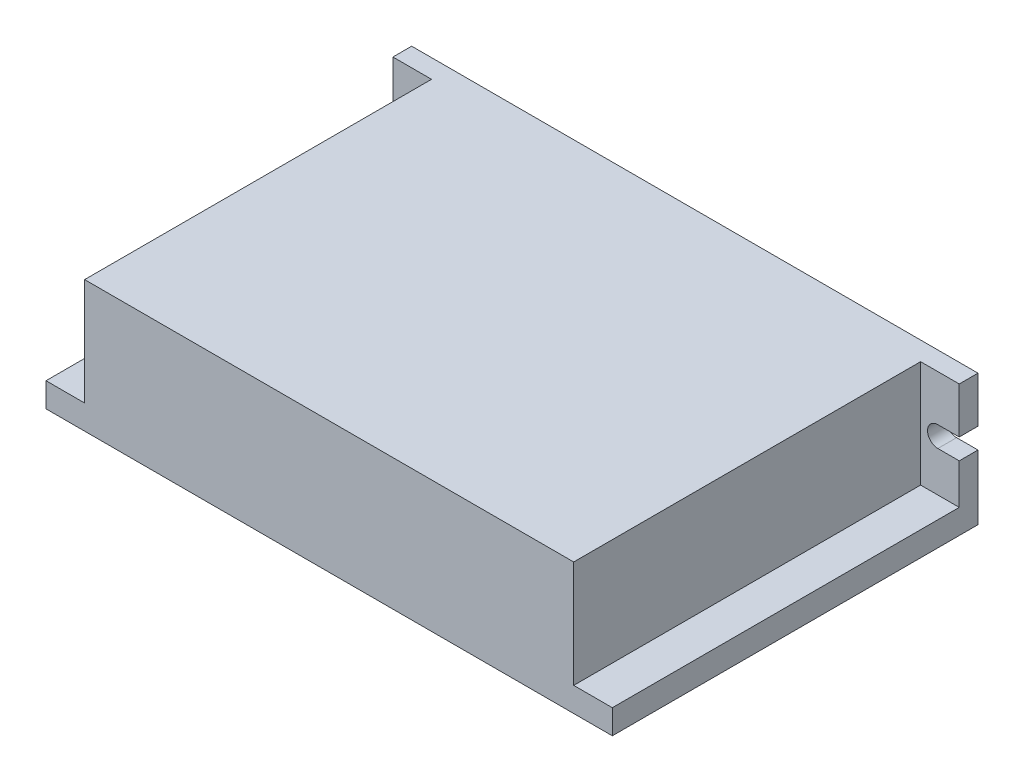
ISO-10303-21;
HEADER;
FILE_DESCRIPTION(('STEP AP214'),'2;1');
FILE_NAME('part.step','',(''),(''),'','','');
FILE_SCHEMA(('AUTOMOTIVE_DESIGN { 1 0 10303 214 1 1 1 1 }'));
ENDSEC;
DATA;
#1=APPLICATION_CONTEXT('core data for automotive mechanical design processes');
#2=APPLICATION_PROTOCOL_DEFINITION('international standard','automotive_design',2000,#1);
#3=PRODUCT_CONTEXT('',#1,'mechanical');
#4=PRODUCT('Part','Part','',(#3));
#5=PRODUCT_RELATED_PRODUCT_CATEGORY('part','',(#4));
#6=PRODUCT_DEFINITION_FORMATION('','',#4);
#7=PRODUCT_DEFINITION_CONTEXT('part definition',#1,'design');
#8=PRODUCT_DEFINITION('design','',#6,#7);
#9=PRODUCT_DEFINITION_SHAPE('','',#8);
#10=(LENGTH_UNIT() NAMED_UNIT(*) SI_UNIT(.MILLI.,.METRE.));
#11=(NAMED_UNIT(*) PLANE_ANGLE_UNIT() SI_UNIT($,.RADIAN.));
#12=(NAMED_UNIT(*) SI_UNIT($,.STERADIAN.) SOLID_ANGLE_UNIT());
#13=UNCERTAINTY_MEASURE_WITH_UNIT(LENGTH_MEASURE(1.E-05),#10,'distance_accuracy_value','');
#14=(GEOMETRIC_REPRESENTATION_CONTEXT(3) GLOBAL_UNCERTAINTY_ASSIGNED_CONTEXT((#13)) GLOBAL_UNIT_ASSIGNED_CONTEXT((#10,
#11,#12)) REPRESENTATION_CONTEXT('',''));
#15=CARTESIAN_POINT('',(0.,0.,0.));
#16=DIRECTION('',(0.,0.,1.));
#17=DIRECTION('',(1.,0.,0.));
#18=AXIS2_PLACEMENT_3D('',#15,#16,#17);
#19=CARTESIAN_POINT('',(151.,52.,0.));
#20=DIRECTION('',(-1.,0.,0.));
#21=DIRECTION('',(0.,0.,1.));
#22=AXIS2_PLACEMENT_3D('',#19,#20,#21);
#23=PLANE('',#22);
#24=DIRECTION('',(0.,0.,-1.));
#25=VECTOR('',#24,1.);
#26=CARTESIAN_POINT('',(151.,17.,0.));
#27=LINE('',#26,#25);
#28=CARTESIAN_POINT('',(151.,17.,0.));
#29=VERTEX_POINT('',#28);
#30=CARTESIAN_POINT('',(151.,17.,-97.5));
#31=VERTEX_POINT('',#30);
#32=EDGE_CURVE('E162',#29,#31,#27,.T.);
#33=ORIENTED_EDGE('',*,*,#32,.T.);
#34=DIRECTION('',(0.,-1.,0.));
#35=VECTOR('',#34,1.);
#36=CARTESIAN_POINT('',(151.,52.,-97.5));
#37=LINE('',#36,#35);
#38=CARTESIAN_POINT('',(151.,34.25,-97.5));
#39=VERTEX_POINT('',#38);
#40=EDGE_CURVE('E213',#39,#31,#37,.T.);
#41=ORIENTED_EDGE('',*,*,#40,.F.);
#42=DIRECTION('',(0.,0.,1.));
#43=VECTOR('',#42,1.);
#44=CARTESIAN_POINT('',(151.,34.25,-97.5));
#45=LINE('',#44,#43);
#46=CARTESIAN_POINT('',(151.,34.25,-92.5));
#47=VERTEX_POINT('',#46);
#48=EDGE_CURVE('E230',#39,#47,#45,.T.);
#49=ORIENTED_EDGE('',*,*,#48,.T.);
#50=DIRECTION('',(0.,1.,0.));
#51=VECTOR('',#50,1.);
#52=CARTESIAN_POINT('',(151.,52.,-92.5));
#53=LINE('',#52,#51);
#54=CARTESIAN_POINT('',(151.,23.5,-92.5));
#55=VERTEX_POINT('',#54);
#56=EDGE_CURVE('E228',#55,#47,#53,.T.);
#57=ORIENTED_EDGE('',*,*,#56,.F.);
#58=DIRECTION('',(0.,0.,1.));
#59=VECTOR('',#58,1.);
#60=CARTESIAN_POINT('',(151.,23.5,-92.5));
#61=LINE('',#60,#59);
#62=CARTESIAN_POINT('',(151.,23.5,0.));
#63=VERTEX_POINT('',#62);
#64=EDGE_CURVE('E182',#55,#63,#61,.T.);
#65=ORIENTED_EDGE('',*,*,#64,.T.);
#66=DIRECTION('',(0.,-1.,0.));
#67=VECTOR('',#66,1.);
#68=CARTESIAN_POINT('',(151.,52.,0.));
#69=LINE('',#68,#67);
#70=EDGE_CURVE('E43',#63,#29,#69,.T.);
#71=ORIENTED_EDGE('',*,*,#70,.T.);
#72=EDGE_LOOP('',(#33,#41,#49,#57,#65,#71));
#73=FACE_BOUND('',#72,.T.);
#74=ADVANCED_FACE('F35',(#73),#23,.F.);
#75=CARTESIAN_POINT('',(0.,52.,0.));
#76=DIRECTION('',(1.,0.,0.));
#77=DIRECTION('',(0.,0.,-1.));
#78=AXIS2_PLACEMENT_3D('',#75,#76,#77);
#79=PLANE('',#78);
#80=DIRECTION('',(0.,0.,1.));
#81=VECTOR('',#80,1.);
#82=CARTESIAN_POINT('',(0.,17.,0.));
#83=LINE('',#82,#81);
#84=CARTESIAN_POINT('',(0.,17.,-97.5));
#85=VERTEX_POINT('',#84);
#86=CARTESIAN_POINT('',(0.,17.,0.));
#87=VERTEX_POINT('',#86);
#88=EDGE_CURVE('E50',#85,#87,#83,.T.);
#89=ORIENTED_EDGE('',*,*,#88,.T.);
#90=DIRECTION('',(0.,-1.,0.));
#91=VECTOR('',#90,1.);
#92=CARTESIAN_POINT('',(0.,52.,0.));
#93=LINE('',#92,#91);
#94=CARTESIAN_POINT('',(0.,23.5,0.));
#95=VERTEX_POINT('',#94);
#96=EDGE_CURVE('E11',#95,#87,#93,.T.);
#97=ORIENTED_EDGE('',*,*,#96,.F.);
#98=DIRECTION('',(0.,0.,1.));
#99=VECTOR('',#98,1.);
#100=CARTESIAN_POINT('',(0.,23.5,-92.5));
#101=LINE('',#100,#99);
#102=CARTESIAN_POINT('',(0.,23.5,-92.5));
#103=VERTEX_POINT('',#102);
#104=EDGE_CURVE('E199',#103,#95,#101,.T.);
#105=ORIENTED_EDGE('',*,*,#104,.F.);
#106=DIRECTION('',(0.,-1.,0.));
#107=VECTOR('',#106,1.);
#108=CARTESIAN_POINT('',(0.,52.,-92.5));
#109=LINE('',#108,#107);
#110=CARTESIAN_POINT('',(0.,34.25,-92.5));
#111=VERTEX_POINT('',#110);
#112=EDGE_CURVE('E184',#111,#103,#109,.T.);
#113=ORIENTED_EDGE('',*,*,#112,.F.);
#114=DIRECTION('',(0.,0.,1.));
#115=VECTOR('',#114,1.);
#116=CARTESIAN_POINT('',(0.,34.25,-97.5));
#117=LINE('',#116,#115);
#118=CARTESIAN_POINT('',(0.,34.25,-97.5));
#119=VERTEX_POINT('',#118);
#120=EDGE_CURVE('E58',#119,#111,#117,.T.);
#121=ORIENTED_EDGE('',*,*,#120,.F.);
#122=DIRECTION('',(0.,-1.,0.));
#123=VECTOR('',#122,1.);
#124=CARTESIAN_POINT('',(0.,52.,-97.5));
#125=LINE('',#124,#123);
#126=EDGE_CURVE('E172',#119,#85,#125,.T.);
#127=ORIENTED_EDGE('',*,*,#126,.T.);
#128=EDGE_LOOP('',(#89,#97,#105,#113,#121,#127));
#129=FACE_BOUND('',#128,.T.);
#130=ADVANCED_FACE('F37',(#129),#79,.F.);
#131=CARTESIAN_POINT('',(0.,52.,0.));
#132=DIRECTION('',(0.,0.,-1.));
#133=DIRECTION('',(-1.,0.,0.));
#134=AXIS2_PLACEMENT_3D('',#131,#132,#133);
#135=PLANE('',#134);
#136=DIRECTION('',(1.,0.,0.));
#137=VECTOR('',#136,1.);
#138=CARTESIAN_POINT('',(0.,17.,0.));
#139=LINE('',#138,#137);
#140=EDGE_CURVE('E159',#87,#29,#139,.T.);
#141=ORIENTED_EDGE('',*,*,#140,.T.);
#142=ORIENTED_EDGE('',*,*,#70,.F.);
#143=DIRECTION('',(1.,0.,0.));
#144=VECTOR('',#143,1.);
#145=CARTESIAN_POINT('',(151.,23.5,0.));
#146=LINE('',#145,#144);
#147=CARTESIAN_POINT('',(140.7,23.5,0.));
#148=VERTEX_POINT('',#147);
#149=EDGE_CURVE('E222',#148,#63,#146,.T.);
#150=ORIENTED_EDGE('',*,*,#149,.F.);
#151=DIRECTION('',(0.,-1.,0.));
#152=VECTOR('',#151,1.);
#153=CARTESIAN_POINT('',(140.7,52.,0.));
#154=LINE('',#153,#152);
#155=CARTESIAN_POINT('',(140.7,52.,0.));
#156=VERTEX_POINT('',#155);
#157=EDGE_CURVE('E224',#156,#148,#154,.T.);
#158=ORIENTED_EDGE('',*,*,#157,.F.);
#159=DIRECTION('',(1.,0.,0.));
#160=VECTOR('',#159,1.);
#161=CARTESIAN_POINT('',(0.,52.,0.));
#162=LINE('',#161,#160);
#163=CARTESIAN_POINT('',(10.3,52.,0.));
#164=VERTEX_POINT('',#163);
#165=EDGE_CURVE('E203',#164,#156,#162,.T.);
#166=ORIENTED_EDGE('',*,*,#165,.F.);
#167=DIRECTION('',(0.,1.,0.));
#168=VECTOR('',#167,1.);
#169=CARTESIAN_POINT('',(10.3,52.,0.));
#170=LINE('',#169,#168);
#171=CARTESIAN_POINT('',(10.3,23.5,0.));
#172=VERTEX_POINT('',#171);
#173=EDGE_CURVE('E180',#172,#164,#170,.T.);
#174=ORIENTED_EDGE('',*,*,#173,.F.);
#175=DIRECTION('',(1.,0.,0.));
#176=VECTOR('',#175,1.);
#177=CARTESIAN_POINT('',(0.,23.5,0.));
#178=LINE('',#177,#176);
#179=EDGE_CURVE('E178',#95,#172,#178,.T.);
#180=ORIENTED_EDGE('',*,*,#179,.F.);
#181=ORIENTED_EDGE('',*,*,#96,.T.);
#182=EDGE_LOOP('',(#141,#142,#150,#158,#166,#174,#180,#181));
#183=FACE_BOUND('',#182,.T.);
#184=ADVANCED_FACE('F175',(#183),#135,.F.);
#185=CARTESIAN_POINT('',(0.,52.,-97.5));
#186=DIRECTION('',(0.,0.,1.));
#187=DIRECTION('',(1.,0.,0.));
#188=AXIS2_PLACEMENT_3D('',#185,#186,#187);
#189=PLANE('',#188);
#190=DIRECTION('',(-1.,0.,0.));
#191=VECTOR('',#190,1.);
#192=CARTESIAN_POINT('',(0.,17.,-97.5));
#193=LINE('',#192,#191);
#194=EDGE_CURVE('E283',#31,#85,#193,.T.);
#195=ORIENTED_EDGE('',*,*,#194,.T.);
#196=ORIENTED_EDGE('',*,*,#126,.F.);
#197=DIRECTION('',(1.,0.,0.));
#198=VECTOR('',#197,1.);
#199=CARTESIAN_POINT('',(5.7,34.25,-97.5));
#200=LINE('',#199,#198);
#201=CARTESIAN_POINT('',(5.7,34.25,-97.5));
#202=VERTEX_POINT('',#201);
#203=EDGE_CURVE('E276',#119,#202,#200,.T.);
#204=ORIENTED_EDGE('',*,*,#203,.T.);
#205=CARTESIAN_POINT('',(5.7,37.,-97.5));
#206=DIRECTION('',(0.,0.,1.));
#207=DIRECTION('',(-1.,0.,0.));
#208=AXIS2_PLACEMENT_3D('',#205,#206,#207);
#209=CIRCLE('',#208,2.75);
#210=CARTESIAN_POINT('',(5.7,39.75,-97.5));
#211=VERTEX_POINT('',#210);
#212=EDGE_CURVE('E271',#202,#211,#209,.T.);
#213=ORIENTED_EDGE('',*,*,#212,.T.);
#214=DIRECTION('',(-1.,0.,0.));
#215=VECTOR('',#214,1.);
#216=CARTESIAN_POINT('',(5.7,39.75,-97.5));
#217=LINE('',#216,#215);
#218=CARTESIAN_POINT('',(0.,39.75,-97.5));
#219=VERTEX_POINT('',#218);
#220=EDGE_CURVE('E268',#211,#219,#217,.T.);
#221=ORIENTED_EDGE('',*,*,#220,.T.);
#222=CARTESIAN_POINT('',(0.,52.,-97.5));
#223=VERTEX_POINT('',#222);
#224=EDGE_CURVE('E210',#223,#219,#125,.T.);
#225=ORIENTED_EDGE('',*,*,#224,.F.);
#226=DIRECTION('',(-1.,0.,0.));
#227=VECTOR('',#226,1.);
#228=CARTESIAN_POINT('',(0.,52.,-97.5));
#229=LINE('',#228,#227);
#230=CARTESIAN_POINT('',(151.,52.,-97.5));
#231=VERTEX_POINT('',#230);
#232=EDGE_CURVE('E208',#231,#223,#229,.T.);
#233=ORIENTED_EDGE('',*,*,#232,.F.);
#234=CARTESIAN_POINT('',(151.,39.75,-97.5));
#235=VERTEX_POINT('',#234);
#236=EDGE_CURVE('E214',#231,#235,#37,.T.);
#237=ORIENTED_EDGE('',*,*,#236,.T.);
#238=DIRECTION('',(-1.,0.,0.));
#239=VECTOR('',#238,1.);
#240=CARTESIAN_POINT('',(145.3,39.75,-97.5));
#241=LINE('',#240,#239);
#242=CARTESIAN_POINT('',(145.3,39.75,-97.5));
#243=VERTEX_POINT('',#242);
#244=EDGE_CURVE('E293',#235,#243,#241,.T.);
#245=ORIENTED_EDGE('',*,*,#244,.T.);
#246=CARTESIAN_POINT('',(145.3,37.,-97.5));
#247=DIRECTION('',(0.,0.,1.));
#248=DIRECTION('',(1.,0.,0.));
#249=AXIS2_PLACEMENT_3D('',#246,#247,#248);
#250=CIRCLE('',#249,2.75);
#251=CARTESIAN_POINT('',(145.3,34.25,-97.5));
#252=VERTEX_POINT('',#251);
#253=EDGE_CURVE('E296',#243,#252,#250,.T.);
#254=ORIENTED_EDGE('',*,*,#253,.T.);
#255=DIRECTION('',(1.,0.,0.));
#256=VECTOR('',#255,1.);
#257=CARTESIAN_POINT('',(145.3,34.25,-97.5));
#258=LINE('',#257,#256);
#259=EDGE_CURVE('E300',#252,#39,#258,.T.);
#260=ORIENTED_EDGE('',*,*,#259,.T.);
#261=ORIENTED_EDGE('',*,*,#40,.T.);
#262=EDGE_LOOP('',(#195,#196,#204,#213,#221,#225,#233,#237,#245,#254,#260,#261));
#263=FACE_BOUND('',#262,.T.);
#264=ADVANCED_FACE('F265',(#263),#189,.F.);
#265=ORIENTED_EDGE('',*,*,#224,.T.);
#266=DIRECTION('',(0.,0.,1.));
#267=VECTOR('',#266,1.);
#268=CARTESIAN_POINT('',(0.,39.75,-97.5));
#269=LINE('',#268,#267);
#270=CARTESIAN_POINT('',(0.,39.75,-92.5));
#271=VERTEX_POINT('',#270);
#272=EDGE_CURVE('E256',#219,#271,#269,.T.);
#273=ORIENTED_EDGE('',*,*,#272,.T.);
#274=CARTESIAN_POINT('',(0.,52.,-92.5));
#275=VERTEX_POINT('',#274);
#276=EDGE_CURVE('E238',#275,#271,#109,.T.);
#277=ORIENTED_EDGE('',*,*,#276,.F.);
#278=DIRECTION('',(0.,0.,1.));
#279=VECTOR('',#278,1.);
#280=CARTESIAN_POINT('',(0.,52.,0.));
#281=LINE('',#280,#279);
#282=EDGE_CURVE('E196',#223,#275,#281,.T.);
#283=ORIENTED_EDGE('',*,*,#282,.F.);
#284=EDGE_LOOP('',(#265,#273,#277,#283));
#285=FACE_BOUND('',#284,.T.);
#286=ADVANCED_FACE('F255',(#285),#79,.F.);
#287=CARTESIAN_POINT('',(151.,39.75,-92.5));
#288=VERTEX_POINT('',#287);
#289=CARTESIAN_POINT('',(151.,52.,-92.5));
#290=VERTEX_POINT('',#289);
#291=EDGE_CURVE('E226',#288,#290,#53,.T.);
#292=ORIENTED_EDGE('',*,*,#291,.F.);
#293=DIRECTION('',(0.,0.,1.));
#294=VECTOR('',#293,1.);
#295=CARTESIAN_POINT('',(151.,39.75,-97.5));
#296=LINE('',#295,#294);
#297=EDGE_CURVE('E303',#235,#288,#296,.T.);
#298=ORIENTED_EDGE('',*,*,#297,.F.);
#299=ORIENTED_EDGE('',*,*,#236,.F.);
#300=DIRECTION('',(0.,0.,-1.));
#301=VECTOR('',#300,1.);
#302=CARTESIAN_POINT('',(151.,52.,0.));
#303=LINE('',#302,#301);
#304=EDGE_CURVE('E206',#290,#231,#303,.T.);
#305=ORIENTED_EDGE('',*,*,#304,.F.);
#306=EDGE_LOOP('',(#292,#298,#299,#305));
#307=FACE_BOUND('',#306,.T.);
#308=ADVANCED_FACE('F340',(#307),#23,.F.);
#309=CARTESIAN_POINT('',(0.,52.,0.));
#310=DIRECTION('',(0.,-1.,0.));
#311=DIRECTION('',(0.,0.,-1.));
#312=AXIS2_PLACEMENT_3D('',#309,#310,#311);
#313=PLANE('',#312);
#314=ORIENTED_EDGE('',*,*,#165,.T.);
#315=DIRECTION('',(0.,0.,1.));
#316=VECTOR('',#315,1.);
#317=CARTESIAN_POINT('',(140.7,52.,-92.5));
#318=LINE('',#317,#316);
#319=CARTESIAN_POINT('',(140.7,52.,-92.5));
#320=VERTEX_POINT('',#319);
#321=EDGE_CURVE('E235',#320,#156,#318,.T.);
#322=ORIENTED_EDGE('',*,*,#321,.F.);
#323=DIRECTION('',(-1.,0.,0.));
#324=VECTOR('',#323,1.);
#325=CARTESIAN_POINT('',(151.,52.,-92.5));
#326=LINE('',#325,#324);
#327=EDGE_CURVE('E318',#290,#320,#326,.T.);
#328=ORIENTED_EDGE('',*,*,#327,.F.);
#329=ORIENTED_EDGE('',*,*,#304,.T.);
#330=ORIENTED_EDGE('',*,*,#232,.T.);
#331=ORIENTED_EDGE('',*,*,#282,.T.);
#332=DIRECTION('',(-1.,0.,0.));
#333=VECTOR('',#332,1.);
#334=CARTESIAN_POINT('',(0.,52.,-92.5));
#335=LINE('',#334,#333);
#336=CARTESIAN_POINT('',(10.3,52.,-92.5));
#337=VERTEX_POINT('',#336);
#338=EDGE_CURVE('E190',#337,#275,#335,.T.);
#339=ORIENTED_EDGE('',*,*,#338,.F.);
#340=DIRECTION('',(0.,0.,1.));
#341=VECTOR('',#340,1.);
#342=CARTESIAN_POINT('',(10.3,52.,-92.5));
#343=LINE('',#342,#341);
#344=EDGE_CURVE('E193',#337,#164,#343,.T.);
#345=ORIENTED_EDGE('',*,*,#344,.T.);
#346=EDGE_LOOP('',(#314,#322,#328,#329,#330,#331,#339,#345));
#347=FACE_BOUND('',#346,.T.);
#348=ADVANCED_FACE('F257',(#347),#313,.F.);
#349=CARTESIAN_POINT('',(10.3,52.,-92.5));
#350=DIRECTION('',(1.,0.,0.));
#351=DIRECTION('',(0.,1.,0.));
#352=AXIS2_PLACEMENT_3D('',#349,#350,#351);
#353=PLANE('',#352);
#354=ORIENTED_EDGE('',*,*,#173,.T.);
#355=ORIENTED_EDGE('',*,*,#344,.F.);
#356=DIRECTION('',(0.,1.,0.));
#357=VECTOR('',#356,1.);
#358=CARTESIAN_POINT('',(10.3,52.,-92.5));
#359=LINE('',#358,#357);
#360=CARTESIAN_POINT('',(10.3,23.5,-92.5));
#361=VERTEX_POINT('',#360);
#362=EDGE_CURVE('E243',#361,#337,#359,.T.);
#363=ORIENTED_EDGE('',*,*,#362,.F.);
#364=DIRECTION('',(0.,0.,1.));
#365=VECTOR('',#364,1.);
#366=CARTESIAN_POINT('',(10.3,23.5,-92.5));
#367=LINE('',#366,#365);
#368=EDGE_CURVE('E197',#361,#172,#367,.T.);
#369=ORIENTED_EDGE('',*,*,#368,.T.);
#370=EDGE_LOOP('',(#354,#355,#363,#369));
#371=FACE_BOUND('',#370,.T.);
#372=ADVANCED_FACE('F364',(#371),#353,.F.);
#373=CARTESIAN_POINT('',(0.,23.5,-92.5));
#374=DIRECTION('',(0.,-1.,0.));
#375=DIRECTION('',(1.,0.,0.));
#376=AXIS2_PLACEMENT_3D('',#373,#374,#375);
#377=PLANE('',#376);
#378=ORIENTED_EDGE('',*,*,#179,.T.);
#379=ORIENTED_EDGE('',*,*,#368,.F.);
#380=DIRECTION('',(1.,0.,0.));
#381=VECTOR('',#380,1.);
#382=CARTESIAN_POINT('',(0.,23.5,-92.5));
#383=LINE('',#382,#381);
#384=EDGE_CURVE('E241',#103,#361,#383,.T.);
#385=ORIENTED_EDGE('',*,*,#384,.F.);
#386=ORIENTED_EDGE('',*,*,#104,.T.);
#387=EDGE_LOOP('',(#378,#379,#385,#386));
#388=FACE_BOUND('',#387,.T.);
#389=ADVANCED_FACE('F373',(#388),#377,.F.);
#390=CARTESIAN_POINT('',(0.,0.,-92.5));
#391=DIRECTION('',(0.,0.,1.));
#392=DIRECTION('',(1.,0.,0.));
#393=AXIS2_PLACEMENT_3D('',#390,#391,#392);
#394=PLANE('',#393);
#395=DIRECTION('',(-1.,0.,0.));
#396=VECTOR('',#395,1.);
#397=CARTESIAN_POINT('',(5.7,39.75,-92.5));
#398=LINE('',#397,#396);
#399=CARTESIAN_POINT('',(5.7,39.75,-92.5));
#400=VERTEX_POINT('',#399);
#401=EDGE_CURVE('E286',#400,#271,#398,.T.);
#402=ORIENTED_EDGE('',*,*,#401,.F.);
#403=CARTESIAN_POINT('',(5.7,37.,-92.5));
#404=DIRECTION('',(0.,0.,1.));
#405=DIRECTION('',(-1.,0.,0.));
#406=AXIS2_PLACEMENT_3D('',#403,#404,#405);
#407=CIRCLE('',#406,2.75);
#408=CARTESIAN_POINT('',(5.7,34.25,-92.5));
#409=VERTEX_POINT('',#408);
#410=EDGE_CURVE('E282',#409,#400,#407,.T.);
#411=ORIENTED_EDGE('',*,*,#410,.F.);
#412=DIRECTION('',(1.,0.,0.));
#413=VECTOR('',#412,1.);
#414=CARTESIAN_POINT('',(5.7,34.25,-92.5));
#415=LINE('',#414,#413);
#416=EDGE_CURVE('E280',#111,#409,#415,.T.);
#417=ORIENTED_EDGE('',*,*,#416,.F.);
#418=ORIENTED_EDGE('',*,*,#112,.T.);
#419=ORIENTED_EDGE('',*,*,#384,.T.);
#420=ORIENTED_EDGE('',*,*,#362,.T.);
#421=ORIENTED_EDGE('',*,*,#338,.T.);
#422=ORIENTED_EDGE('',*,*,#276,.T.);
#423=EDGE_LOOP('',(#402,#411,#417,#418,#419,#420,#421,#422));
#424=FACE_BOUND('',#423,.T.);
#425=ADVANCED_FACE('F250',(#424),#394,.T.);
#426=CARTESIAN_POINT('',(151.,23.5,-92.5));
#427=DIRECTION('',(0.,-1.,0.));
#428=DIRECTION('',(1.,0.,0.));
#429=AXIS2_PLACEMENT_3D('',#426,#427,#428);
#430=PLANE('',#429);
#431=ORIENTED_EDGE('',*,*,#149,.T.);
#432=ORIENTED_EDGE('',*,*,#64,.F.);
#433=DIRECTION('',(1.,0.,0.));
#434=VECTOR('',#433,1.);
#435=CARTESIAN_POINT('',(151.,23.5,-92.5));
#436=LINE('',#435,#434);
#437=CARTESIAN_POINT('',(140.7,23.5,-92.5));
#438=VERTEX_POINT('',#437);
#439=EDGE_CURVE('E237',#438,#55,#436,.T.);
#440=ORIENTED_EDGE('',*,*,#439,.F.);
#441=DIRECTION('',(0.,0.,1.));
#442=VECTOR('',#441,1.);
#443=CARTESIAN_POINT('',(140.7,23.5,-92.5));
#444=LINE('',#443,#442);
#445=EDGE_CURVE('E187',#438,#148,#444,.T.);
#446=ORIENTED_EDGE('',*,*,#445,.T.);
#447=EDGE_LOOP('',(#431,#432,#440,#446));
#448=FACE_BOUND('',#447,.T.);
#449=ADVANCED_FACE('F381',(#448),#430,.F.);
#450=CARTESIAN_POINT('',(140.7,52.,-92.5));
#451=DIRECTION('',(-1.,0.,0.));
#452=DIRECTION('',(0.,0.,1.));
#453=AXIS2_PLACEMENT_3D('',#450,#451,#452);
#454=PLANE('',#453);
#455=ORIENTED_EDGE('',*,*,#157,.T.);
#456=ORIENTED_EDGE('',*,*,#445,.F.);
#457=DIRECTION('',(0.,-1.,0.));
#458=VECTOR('',#457,1.);
#459=CARTESIAN_POINT('',(140.7,52.,-92.5));
#460=LINE('',#459,#458);
#461=EDGE_CURVE('E321',#320,#438,#460,.T.);
#462=ORIENTED_EDGE('',*,*,#461,.F.);
#463=ORIENTED_EDGE('',*,*,#321,.T.);
#464=EDGE_LOOP('',(#455,#456,#462,#463));
#465=FACE_BOUND('',#464,.T.);
#466=ADVANCED_FACE('F382',(#465),#454,.F.);
#467=CARTESIAN_POINT('',(0.,0.,-92.5));
#468=DIRECTION('',(0.,0.,-1.));
#469=DIRECTION('',(-1.,0.,0.));
#470=AXIS2_PLACEMENT_3D('',#467,#468,#469);
#471=PLANE('',#470);
#472=ORIENTED_EDGE('',*,*,#56,.T.);
#473=DIRECTION('',(1.,0.,0.));
#474=VECTOR('',#473,1.);
#475=CARTESIAN_POINT('',(145.3,34.25,-92.5));
#476=LINE('',#475,#474);
#477=CARTESIAN_POINT('',(145.3,34.25,-92.5));
#478=VERTEX_POINT('',#477);
#479=EDGE_CURVE('E297',#478,#47,#476,.T.);
#480=ORIENTED_EDGE('',*,*,#479,.F.);
#481=CARTESIAN_POINT('',(145.3,37.,-92.5));
#482=DIRECTION('',(0.,0.,1.));
#483=DIRECTION('',(1.,0.,0.));
#484=AXIS2_PLACEMENT_3D('',#481,#482,#483);
#485=CIRCLE('',#484,2.75);
#486=CARTESIAN_POINT('',(145.3,39.75,-92.5));
#487=VERTEX_POINT('',#486);
#488=EDGE_CURVE('E306',#487,#478,#485,.T.);
#489=ORIENTED_EDGE('',*,*,#488,.F.);
#490=DIRECTION('',(-1.,0.,0.));
#491=VECTOR('',#490,1.);
#492=CARTESIAN_POINT('',(145.3,39.75,-92.5));
#493=LINE('',#492,#491);
#494=EDGE_CURVE('E289',#288,#487,#493,.T.);
#495=ORIENTED_EDGE('',*,*,#494,.F.);
#496=ORIENTED_EDGE('',*,*,#291,.T.);
#497=ORIENTED_EDGE('',*,*,#327,.T.);
#498=ORIENTED_EDGE('',*,*,#461,.T.);
#499=ORIENTED_EDGE('',*,*,#439,.T.);
#500=EDGE_LOOP('',(#472,#480,#489,#495,#496,#497,#498,#499));
#501=FACE_BOUND('',#500,.T.);
#502=ADVANCED_FACE('F326',(#501),#471,.F.);
#503=CARTESIAN_POINT('',(145.3,34.25,-97.5));
#504=DIRECTION('',(0.,-1.,0.));
#505=DIRECTION('',(0.,0.,-1.));
#506=AXIS2_PLACEMENT_3D('',#503,#504,#505);
#507=PLANE('',#506);
#508=ORIENTED_EDGE('',*,*,#479,.T.);
#509=ORIENTED_EDGE('',*,*,#48,.F.);
#510=ORIENTED_EDGE('',*,*,#259,.F.);
#511=DIRECTION('',(0.,0.,1.));
#512=VECTOR('',#511,1.);
#513=CARTESIAN_POINT('',(145.3,34.25,-97.5));
#514=LINE('',#513,#512);
#515=EDGE_CURVE('E312',#252,#478,#514,.T.);
#516=ORIENTED_EDGE('',*,*,#515,.T.);
#517=EDGE_LOOP('',(#508,#509,#510,#516));
#518=FACE_BOUND('',#517,.T.);
#519=ADVANCED_FACE('F330',(#518),#507,.F.);
#520=CARTESIAN_POINT('',(145.3,37.,-97.5));
#521=DIRECTION('',(0.,0.,1.));
#522=DIRECTION('',(1.,0.,0.));
#523=AXIS2_PLACEMENT_3D('',#520,#521,#522);
#524=CYLINDRICAL_SURFACE('',#523,2.75);
#525=ORIENTED_EDGE('',*,*,#488,.T.);
#526=ORIENTED_EDGE('',*,*,#515,.F.);
#527=ORIENTED_EDGE('',*,*,#253,.F.);
#528=DIRECTION('',(0.,0.,1.));
#529=VECTOR('',#528,1.);
#530=CARTESIAN_POINT('',(145.3,39.75,-97.5));
#531=LINE('',#530,#529);
#532=EDGE_CURVE('E314',#243,#487,#531,.T.);
#533=ORIENTED_EDGE('',*,*,#532,.T.);
#534=EDGE_LOOP('',(#525,#526,#527,#533));
#535=FACE_BOUND('',#534,.T.);
#536=ADVANCED_FACE('F333',(#535),#524,.F.);
#537=CARTESIAN_POINT('',(145.3,39.75,-97.5));
#538=DIRECTION('',(0.,1.,0.));
#539=DIRECTION('',(0.,0.,1.));
#540=AXIS2_PLACEMENT_3D('',#537,#538,#539);
#541=PLANE('',#540);
#542=ORIENTED_EDGE('',*,*,#494,.T.);
#543=ORIENTED_EDGE('',*,*,#532,.F.);
#544=ORIENTED_EDGE('',*,*,#244,.F.);
#545=ORIENTED_EDGE('',*,*,#297,.T.);
#546=EDGE_LOOP('',(#542,#543,#544,#545));
#547=FACE_BOUND('',#546,.T.);
#548=ADVANCED_FACE('F341',(#547),#541,.F.);
#549=CARTESIAN_POINT('',(5.7,39.75,-97.5));
#550=DIRECTION('',(0.,1.,0.));
#551=DIRECTION('',(0.,0.,1.));
#552=AXIS2_PLACEMENT_3D('',#549,#550,#551);
#553=PLANE('',#552);
#554=ORIENTED_EDGE('',*,*,#401,.T.);
#555=ORIENTED_EDGE('',*,*,#272,.F.);
#556=ORIENTED_EDGE('',*,*,#220,.F.);
#557=DIRECTION('',(0.,0.,1.));
#558=VECTOR('',#557,1.);
#559=CARTESIAN_POINT('',(5.7,39.75,-97.5));
#560=LINE('',#559,#558);
#561=EDGE_CURVE('E290',#211,#400,#560,.T.);
#562=ORIENTED_EDGE('',*,*,#561,.T.);
#563=EDGE_LOOP('',(#554,#555,#556,#562));
#564=FACE_BOUND('',#563,.T.);
#565=ADVANCED_FACE('F343',(#564),#553,.F.);
#566=CARTESIAN_POINT('',(5.7,37.,-97.5));
#567=DIRECTION('',(0.,0.,1.));
#568=DIRECTION('',(1.,0.,0.));
#569=AXIS2_PLACEMENT_3D('',#566,#567,#568);
#570=CYLINDRICAL_SURFACE('',#569,2.75);
#571=ORIENTED_EDGE('',*,*,#410,.T.);
#572=ORIENTED_EDGE('',*,*,#561,.F.);
#573=ORIENTED_EDGE('',*,*,#212,.F.);
#574=DIRECTION('',(0.,0.,1.));
#575=VECTOR('',#574,1.);
#576=CARTESIAN_POINT('',(5.7,34.25,-97.5));
#577=LINE('',#576,#575);
#578=EDGE_CURVE('E274',#202,#409,#577,.T.);
#579=ORIENTED_EDGE('',*,*,#578,.T.);
#580=EDGE_LOOP('',(#571,#572,#573,#579));
#581=FACE_BOUND('',#580,.T.);
#582=ADVANCED_FACE('F349',(#581),#570,.F.);
#583=CARTESIAN_POINT('',(5.7,34.25,-97.5));
#584=DIRECTION('',(0.,-1.,0.));
#585=DIRECTION('',(0.,0.,-1.));
#586=AXIS2_PLACEMENT_3D('',#583,#584,#585);
#587=PLANE('',#586);
#588=ORIENTED_EDGE('',*,*,#416,.T.);
#589=ORIENTED_EDGE('',*,*,#578,.F.);
#590=ORIENTED_EDGE('',*,*,#203,.F.);
#591=ORIENTED_EDGE('',*,*,#120,.T.);
#592=EDGE_LOOP('',(#588,#589,#590,#591));
#593=FACE_BOUND('',#592,.T.);
#594=ADVANCED_FACE('F395',(#593),#587,.F.);
#595=CARTESIAN_POINT('',(0.,17.,0.));
#596=DIRECTION('',(0.,-1.,0.));
#597=DIRECTION('',(0.,0.,-1.));
#598=AXIS2_PLACEMENT_3D('',#595,#596,#597);
#599=PLANE('',#598);
#600=ORIENTED_EDGE('',*,*,#88,.F.);
#601=ORIENTED_EDGE('',*,*,#194,.F.);
#602=ORIENTED_EDGE('',*,*,#32,.F.);
#603=ORIENTED_EDGE('',*,*,#140,.F.);
#604=EDGE_LOOP('',(#600,#601,#602,#603));
#605=FACE_BOUND('',#604,.T.);
#606=ADVANCED_FACE('F160',(#605),#599,.T.);
#607=CLOSED_SHELL('',(#74,#130,#184,#264,#286,#308,#348,#372,#389,#425,#449,#466,#502,#519,#536,
#548,#565,#582,#594,#606));
#608=MANIFOLD_SOLID_BREP('B2',#607);
#609=ADVANCED_BREP_SHAPE_REPRESENTATION('',(#18,#608),#14);
#610=SHAPE_DEFINITION_REPRESENTATION(#9,#609);
ENDSEC;
END-ISO-10303-21;
